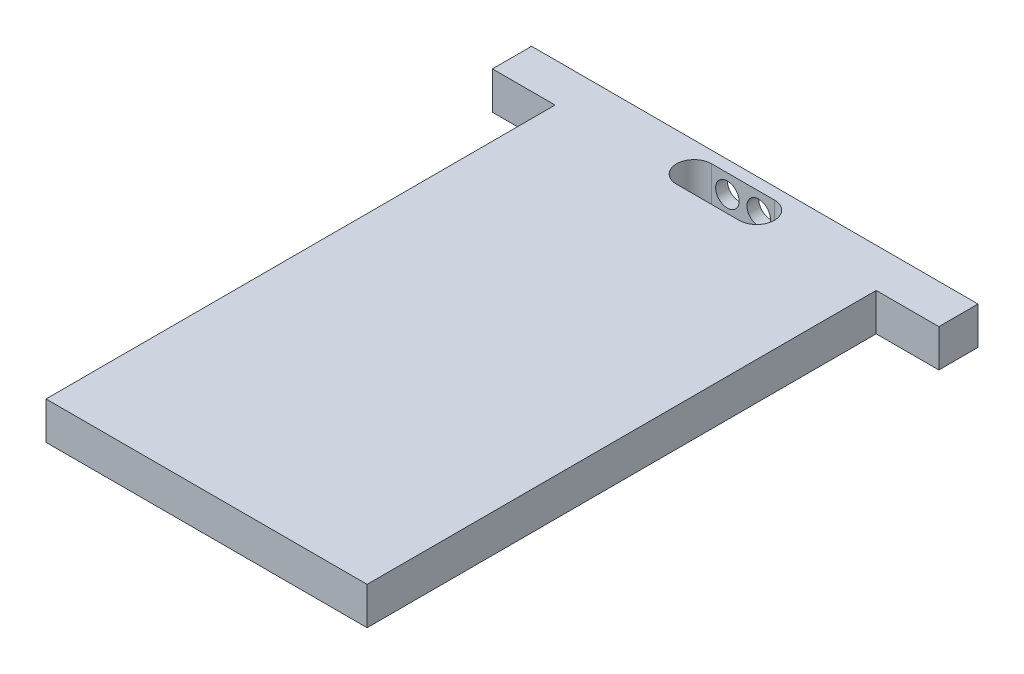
ISO-10303-21;
HEADER;
FILE_DESCRIPTION(('STEP AP214'),'2;1');
FILE_NAME('part.step','',(''),(''),'','','');
FILE_SCHEMA(('AUTOMOTIVE_DESIGN { 1 0 10303 214 1 1 1 1 }'));
ENDSEC;
DATA;
#1=APPLICATION_CONTEXT('core data for automotive mechanical design processes');
#2=APPLICATION_PROTOCOL_DEFINITION('international standard','automotive_design',2000,#1);
#3=PRODUCT_CONTEXT('',#1,'mechanical');
#4=PRODUCT('Part','Part','',(#3));
#5=PRODUCT_RELATED_PRODUCT_CATEGORY('part','',(#4));
#6=PRODUCT_DEFINITION_FORMATION('','',#4);
#7=PRODUCT_DEFINITION_CONTEXT('part definition',#1,'design');
#8=PRODUCT_DEFINITION('design','',#6,#7);
#9=PRODUCT_DEFINITION_SHAPE('','',#8);
#10=(LENGTH_UNIT() NAMED_UNIT(*) SI_UNIT(.MILLI.,.METRE.));
#11=(NAMED_UNIT(*) PLANE_ANGLE_UNIT() SI_UNIT($,.RADIAN.));
#12=(NAMED_UNIT(*) SI_UNIT($,.STERADIAN.) SOLID_ANGLE_UNIT());
#13=UNCERTAINTY_MEASURE_WITH_UNIT(LENGTH_MEASURE(1.E-05),#10,'distance_accuracy_value','');
#14=(GEOMETRIC_REPRESENTATION_CONTEXT(3) GLOBAL_UNCERTAINTY_ASSIGNED_CONTEXT((#13)) GLOBAL_UNIT_ASSIGNED_CONTEXT((#10,
#11,#12)) REPRESENTATION_CONTEXT('',''));
#15=CARTESIAN_POINT('',(0.,0.,0.));
#16=DIRECTION('',(0.,0.,1.));
#17=DIRECTION('',(1.,0.,0.));
#18=AXIS2_PLACEMENT_3D('',#15,#16,#17);
#19=CARTESIAN_POINT('',(20.5,-2.4,32.5));
#20=DIRECTION('',(-1.,0.,0.));
#21=DIRECTION('',(0.,0.,1.));
#22=AXIS2_PLACEMENT_3D('',#19,#20,#21);
#23=PLANE('',#22);
#24=DIRECTION('',(0.,1.,0.));
#25=VECTOR('',#24,1.);
#26=CARTESIAN_POINT('',(20.5,-2.4,-32.5));
#27=LINE('',#26,#25);
#28=CARTESIAN_POINT('',(20.5,-2.4,-32.5));
#29=VERTEX_POINT('',#28);
#30=CARTESIAN_POINT('',(20.5,2.4,-32.5));
#31=VERTEX_POINT('',#30);
#32=EDGE_CURVE('E189',#29,#31,#27,.T.);
#33=ORIENTED_EDGE('',*,*,#32,.T.);
#34=DIRECTION('',(0.,0.,-1.));
#35=VECTOR('',#34,1.);
#36=CARTESIAN_POINT('',(20.5,2.4,32.5));
#37=LINE('',#36,#35);
#38=CARTESIAN_POINT('',(20.5,2.4,32.5));
#39=VERTEX_POINT('',#38);
#40=EDGE_CURVE('E11',#39,#31,#37,.T.);
#41=ORIENTED_EDGE('',*,*,#40,.F.);
#42=DIRECTION('',(0.,1.,0.));
#43=VECTOR('',#42,1.);
#44=CARTESIAN_POINT('',(20.5,-2.4,32.5));
#45=LINE('',#44,#43);
#46=CARTESIAN_POINT('',(20.5,-2.4,32.5));
#47=VERTEX_POINT('',#46);
#48=EDGE_CURVE('E196',#47,#39,#45,.T.);
#49=ORIENTED_EDGE('',*,*,#48,.F.);
#50=DIRECTION('',(0.,0.,-1.));
#51=VECTOR('',#50,1.);
#52=CARTESIAN_POINT('',(20.5,-2.4,32.5));
#53=LINE('',#52,#51);
#54=EDGE_CURVE('E206',#47,#29,#53,.T.);
#55=ORIENTED_EDGE('',*,*,#54,.T.);
#56=EDGE_LOOP('',(#33,#41,#49,#55));
#57=FACE_BOUND('',#56,.T.);
#58=ADVANCED_FACE('F33',(#57),#23,.F.);
#59=CARTESIAN_POINT('',(-20.5,2.4,32.5));
#60=DIRECTION('',(0.,-1.,0.));
#61=DIRECTION('',(0.,0.,-1.));
#62=AXIS2_PLACEMENT_3D('',#59,#60,#61);
#63=PLANE('',#62);
#64=DIRECTION('',(1.,0.,0.));
#65=VECTOR('',#64,1.);
#66=CARTESIAN_POINT('',(-4.,2.4,-31.5));
#67=LINE('',#66,#65);
#68=CARTESIAN_POINT('',(-4.,2.4,-31.5));
#69=VERTEX_POINT('',#68);
#70=CARTESIAN_POINT('',(4.,2.4,-31.5));
#71=VERTEX_POINT('',#70);
#72=EDGE_CURVE('E151',#69,#71,#67,.T.);
#73=ORIENTED_EDGE('',*,*,#72,.F.);
#74=CARTESIAN_POINT('',(-4.,2.4,-33.75));
#75=DIRECTION('',(0.,1.,0.));
#76=DIRECTION('',(0.,0.,1.));
#77=AXIS2_PLACEMENT_3D('',#74,#75,#76);
#78=CIRCLE('',#77,2.25);
#79=CARTESIAN_POINT('',(-4.,2.4,-36.));
#80=VERTEX_POINT('',#79);
#81=EDGE_CURVE('E47',#80,#69,#78,.T.);
#82=ORIENTED_EDGE('',*,*,#81,.F.);
#83=DIRECTION('',(-1.,0.,0.));
#84=VECTOR('',#83,1.);
#85=CARTESIAN_POINT('',(-4.,2.4,-36.));
#86=LINE('',#85,#84);
#87=CARTESIAN_POINT('',(4.,2.4,-36.));
#88=VERTEX_POINT('',#87);
#89=EDGE_CURVE('E139',#88,#80,#86,.T.);
#90=ORIENTED_EDGE('',*,*,#89,.F.);
#91=CARTESIAN_POINT('',(4.,2.4,-33.75));
#92=DIRECTION('',(0.,1.,0.));
#93=DIRECTION('',(0.,0.,1.));
#94=AXIS2_PLACEMENT_3D('',#91,#92,#93);
#95=CIRCLE('',#94,2.25);
#96=EDGE_CURVE('E142',#71,#88,#95,.T.);
#97=ORIENTED_EDGE('',*,*,#96,.F.);
#98=EDGE_LOOP('',(#73,#82,#90,#97));
#99=FACE_BOUND('',#98,.T.);
#100=ORIENTED_EDGE('',*,*,#40,.T.);
#101=DIRECTION('',(-1.,0.,0.));
#102=VECTOR('',#101,1.);
#103=CARTESIAN_POINT('',(-28.5,2.4,-32.5));
#104=LINE('',#103,#102);
#105=CARTESIAN_POINT('',(28.5,2.4,-32.5));
#106=VERTEX_POINT('',#105);
#107=EDGE_CURVE('E179',#106,#31,#104,.T.);
#108=ORIENTED_EDGE('',*,*,#107,.F.);
#109=DIRECTION('',(0.,0.,1.));
#110=VECTOR('',#109,1.);
#111=CARTESIAN_POINT('',(28.5,2.4,-37.5));
#112=LINE('',#111,#110);
#113=CARTESIAN_POINT('',(28.5,2.4,-37.5));
#114=VERTEX_POINT('',#113);
#115=EDGE_CURVE('E175',#114,#106,#112,.T.);
#116=ORIENTED_EDGE('',*,*,#115,.F.);
#117=DIRECTION('',(-1.,0.,0.));
#118=VECTOR('',#117,1.);
#119=CARTESIAN_POINT('',(-28.5,2.4,-37.5));
#120=LINE('',#119,#118);
#121=CARTESIAN_POINT('',(-28.5,2.4,-37.5));
#122=VERTEX_POINT('',#121);
#123=EDGE_CURVE('E165',#114,#122,#120,.T.);
#124=ORIENTED_EDGE('',*,*,#123,.T.);
#125=DIRECTION('',(0.,0.,1.));
#126=VECTOR('',#125,1.);
#127=CARTESIAN_POINT('',(-28.5,2.4,-37.5));
#128=LINE('',#127,#126);
#129=CARTESIAN_POINT('',(-28.5,2.4,-32.5));
#130=VERTEX_POINT('',#129);
#131=EDGE_CURVE('E192',#122,#130,#128,.T.);
#132=ORIENTED_EDGE('',*,*,#131,.T.);
#133=CARTESIAN_POINT('',(-20.5,2.4,-32.5));
#134=VERTEX_POINT('',#133);
#135=EDGE_CURVE('E178',#134,#130,#104,.T.);
#136=ORIENTED_EDGE('',*,*,#135,.F.);
#137=DIRECTION('',(0.,0.,-1.));
#138=VECTOR('',#137,1.);
#139=CARTESIAN_POINT('',(-20.5,2.4,32.5));
#140=LINE('',#139,#138);
#141=CARTESIAN_POINT('',(-20.5,2.4,32.5));
#142=VERTEX_POINT('',#141);
#143=EDGE_CURVE('E40',#142,#134,#140,.T.);
#144=ORIENTED_EDGE('',*,*,#143,.F.);
#145=DIRECTION('',(-1.,0.,0.));
#146=VECTOR('',#145,1.);
#147=CARTESIAN_POINT('',(-20.5,2.4,32.5));
#148=LINE('',#147,#146);
#149=EDGE_CURVE('E199',#39,#142,#148,.T.);
#150=ORIENTED_EDGE('',*,*,#149,.F.);
#151=EDGE_LOOP('',(#100,#108,#116,#124,#132,#136,#144,#150));
#152=FACE_BOUND('',#151,.T.);
#153=ADVANCED_FACE('F223',(#99,#152),#63,.F.);
#154=CARTESIAN_POINT('',(-20.5,-2.4,32.5));
#155=DIRECTION('',(1.,0.,0.));
#156=DIRECTION('',(0.,0.,-1.));
#157=AXIS2_PLACEMENT_3D('',#154,#155,#156);
#158=PLANE('',#157);
#159=DIRECTION('',(0.,-1.,0.));
#160=VECTOR('',#159,1.);
#161=CARTESIAN_POINT('',(-20.5,-2.4,-32.5));
#162=LINE('',#161,#160);
#163=CARTESIAN_POINT('',(-20.5,-2.4,-32.5));
#164=VERTEX_POINT('',#163);
#165=EDGE_CURVE('E200',#134,#164,#162,.T.);
#166=ORIENTED_EDGE('',*,*,#165,.T.);
#167=DIRECTION('',(0.,0.,-1.));
#168=VECTOR('',#167,1.);
#169=CARTESIAN_POINT('',(-20.5,-2.4,32.5));
#170=LINE('',#169,#168);
#171=CARTESIAN_POINT('',(-20.5,-2.4,32.5));
#172=VERTEX_POINT('',#171);
#173=EDGE_CURVE('E213',#172,#164,#170,.T.);
#174=ORIENTED_EDGE('',*,*,#173,.F.);
#175=DIRECTION('',(0.,-1.,0.));
#176=VECTOR('',#175,1.);
#177=CARTESIAN_POINT('',(-20.5,-2.4,32.5));
#178=LINE('',#177,#176);
#179=EDGE_CURVE('E202',#142,#172,#178,.T.);
#180=ORIENTED_EDGE('',*,*,#179,.F.);
#181=ORIENTED_EDGE('',*,*,#143,.T.);
#182=EDGE_LOOP('',(#166,#174,#180,#181));
#183=FACE_BOUND('',#182,.T.);
#184=ADVANCED_FACE('F219',(#183),#158,.F.);
#185=CARTESIAN_POINT('',(-20.5,-2.4,32.5));
#186=DIRECTION('',(0.,1.,0.));
#187=DIRECTION('',(0.,0.,1.));
#188=AXIS2_PLACEMENT_3D('',#185,#186,#187);
#189=PLANE('',#188);
#190=DIRECTION('',(-1.,0.,0.));
#191=VECTOR('',#190,1.);
#192=CARTESIAN_POINT('',(-4.,-2.4,-36.));
#193=LINE('',#192,#191);
#194=CARTESIAN_POINT('',(4.,-2.4,-36.));
#195=VERTEX_POINT('',#194);
#196=CARTESIAN_POINT('',(-4.,-2.4,-36.));
#197=VERTEX_POINT('',#196);
#198=EDGE_CURVE('E129',#195,#197,#193,.T.);
#199=ORIENTED_EDGE('',*,*,#198,.T.);
#200=CARTESIAN_POINT('',(-4.,-2.4,-33.75));
#201=DIRECTION('',(0.,1.,0.));
#202=DIRECTION('',(0.,0.,1.));
#203=AXIS2_PLACEMENT_3D('',#200,#201,#202);
#204=CIRCLE('',#203,2.25);
#205=CARTESIAN_POINT('',(-4.,-2.4,-31.5));
#206=VERTEX_POINT('',#205);
#207=EDGE_CURVE('E123',#197,#206,#204,.T.);
#208=ORIENTED_EDGE('',*,*,#207,.T.);
#209=DIRECTION('',(1.,0.,0.));
#210=VECTOR('',#209,1.);
#211=CARTESIAN_POINT('',(-4.,-2.4,-31.5));
#212=LINE('',#211,#210);
#213=CARTESIAN_POINT('',(4.,-2.4,-31.5));
#214=VERTEX_POINT('',#213);
#215=EDGE_CURVE('E132',#206,#214,#212,.T.);
#216=ORIENTED_EDGE('',*,*,#215,.T.);
#217=CARTESIAN_POINT('',(4.,-2.4,-33.75));
#218=DIRECTION('',(0.,1.,0.));
#219=DIRECTION('',(0.,0.,1.));
#220=AXIS2_PLACEMENT_3D('',#217,#218,#219);
#221=CIRCLE('',#220,2.25);
#222=EDGE_CURVE('E55',#214,#195,#221,.T.);
#223=ORIENTED_EDGE('',*,*,#222,.T.);
#224=EDGE_LOOP('',(#199,#208,#216,#223));
#225=FACE_BOUND('',#224,.T.);
#226=ORIENTED_EDGE('',*,*,#173,.T.);
#227=DIRECTION('',(1.,0.,0.));
#228=VECTOR('',#227,1.);
#229=CARTESIAN_POINT('',(-28.5,-2.4,-32.5));
#230=LINE('',#229,#228);
#231=CARTESIAN_POINT('',(-28.5,-2.4,-32.5));
#232=VERTEX_POINT('',#231);
#233=EDGE_CURVE('E166',#232,#164,#230,.T.);
#234=ORIENTED_EDGE('',*,*,#233,.F.);
#235=DIRECTION('',(0.,0.,1.));
#236=VECTOR('',#235,1.);
#237=CARTESIAN_POINT('',(-28.5,-2.4,-37.5));
#238=LINE('',#237,#236);
#239=CARTESIAN_POINT('',(-28.5,-2.4,-37.5));
#240=VERTEX_POINT('',#239);
#241=EDGE_CURVE('E190',#240,#232,#238,.T.);
#242=ORIENTED_EDGE('',*,*,#241,.F.);
#243=DIRECTION('',(1.,0.,0.));
#244=VECTOR('',#243,1.);
#245=CARTESIAN_POINT('',(-28.5,-2.4,-37.5));
#246=LINE('',#245,#244);
#247=CARTESIAN_POINT('',(28.5,-2.4,-37.5));
#248=VERTEX_POINT('',#247);
#249=EDGE_CURVE('E172',#240,#248,#246,.T.);
#250=ORIENTED_EDGE('',*,*,#249,.T.);
#251=DIRECTION('',(0.,0.,1.));
#252=VECTOR('',#251,1.);
#253=CARTESIAN_POINT('',(28.5,-2.4,-37.5));
#254=LINE('',#253,#252);
#255=CARTESIAN_POINT('',(28.5,-2.4,-32.5));
#256=VERTEX_POINT('',#255);
#257=EDGE_CURVE('E186',#248,#256,#254,.T.);
#258=ORIENTED_EDGE('',*,*,#257,.T.);
#259=EDGE_CURVE('E184',#29,#256,#230,.T.);
#260=ORIENTED_EDGE('',*,*,#259,.F.);
#261=ORIENTED_EDGE('',*,*,#54,.F.);
#262=DIRECTION('',(1.,0.,0.));
#263=VECTOR('',#262,1.);
#264=CARTESIAN_POINT('',(-20.5,-2.4,32.5));
#265=LINE('',#264,#263);
#266=EDGE_CURVE('E204',#172,#47,#265,.T.);
#267=ORIENTED_EDGE('',*,*,#266,.F.);
#268=EDGE_LOOP('',(#226,#234,#242,#250,#258,#260,#261,#267));
#269=FACE_BOUND('',#268,.T.);
#270=ADVANCED_FACE('F136',(#225,#269),#189,.F.);
#271=CARTESIAN_POINT('',(0.,0.,32.5));
#272=DIRECTION('',(0.,0.,-1.));
#273=DIRECTION('',(-1.,0.,0.));
#274=AXIS2_PLACEMENT_3D('',#271,#272,#273);
#275=PLANE('',#274);
#276=ORIENTED_EDGE('',*,*,#48,.T.);
#277=ORIENTED_EDGE('',*,*,#149,.T.);
#278=ORIENTED_EDGE('',*,*,#179,.T.);
#279=ORIENTED_EDGE('',*,*,#266,.T.);
#280=EDGE_LOOP('',(#276,#277,#278,#279));
#281=FACE_BOUND('',#280,.T.);
#282=ADVANCED_FACE('F233',(#281),#275,.F.);
#283=CARTESIAN_POINT('',(0.,0.,-32.5));
#284=DIRECTION('',(0.,0.,-1.));
#285=DIRECTION('',(-1.,0.,0.));
#286=AXIS2_PLACEMENT_3D('',#283,#284,#285);
#287=PLANE('',#286);
#288=ORIENTED_EDGE('',*,*,#32,.F.);
#289=ORIENTED_EDGE('',*,*,#259,.T.);
#290=DIRECTION('',(0.,1.,0.));
#291=VECTOR('',#290,1.);
#292=CARTESIAN_POINT('',(28.5,-2.4,-32.5));
#293=LINE('',#292,#291);
#294=EDGE_CURVE('E158',#256,#106,#293,.T.);
#295=ORIENTED_EDGE('',*,*,#294,.T.);
#296=ORIENTED_EDGE('',*,*,#107,.T.);
#297=EDGE_LOOP('',(#288,#289,#295,#296));
#298=FACE_BOUND('',#297,.T.);
#299=ADVANCED_FACE('F240',(#298),#287,.F.);
#300=CARTESIAN_POINT('',(28.5,-2.4,-37.5));
#301=DIRECTION('',(1.,0.,0.));
#302=DIRECTION('',(0.,0.,-1.));
#303=AXIS2_PLACEMENT_3D('',#300,#301,#302);
#304=PLANE('',#303);
#305=ORIENTED_EDGE('',*,*,#294,.F.);
#306=ORIENTED_EDGE('',*,*,#257,.F.);
#307=DIRECTION('',(0.,1.,0.));
#308=VECTOR('',#307,1.);
#309=CARTESIAN_POINT('',(28.5,-2.4,-37.5));
#310=LINE('',#309,#308);
#311=EDGE_CURVE('E162',#248,#114,#310,.T.);
#312=ORIENTED_EDGE('',*,*,#311,.T.);
#313=ORIENTED_EDGE('',*,*,#115,.T.);
#314=EDGE_LOOP('',(#305,#306,#312,#313));
#315=FACE_BOUND('',#314,.T.);
#316=ADVANCED_FACE('F242',(#315),#304,.T.);
#317=CARTESIAN_POINT('',(-28.5,-2.4,-37.5));
#318=DIRECTION('',(-1.,0.,0.));
#319=DIRECTION('',(0.,0.,1.));
#320=AXIS2_PLACEMENT_3D('',#317,#318,#319);
#321=PLANE('',#320);
#322=DIRECTION('',(0.,-1.,0.));
#323=VECTOR('',#322,1.);
#324=CARTESIAN_POINT('',(-28.5,-2.4,-32.5));
#325=LINE('',#324,#323);
#326=EDGE_CURVE('E181',#130,#232,#325,.T.);
#327=ORIENTED_EDGE('',*,*,#326,.F.);
#328=ORIENTED_EDGE('',*,*,#131,.F.);
#329=DIRECTION('',(0.,-1.,0.));
#330=VECTOR('',#329,1.);
#331=CARTESIAN_POINT('',(-28.5,-2.4,-37.5));
#332=LINE('',#331,#330);
#333=EDGE_CURVE('E169',#122,#240,#332,.T.);
#334=ORIENTED_EDGE('',*,*,#333,.T.);
#335=ORIENTED_EDGE('',*,*,#241,.T.);
#336=EDGE_LOOP('',(#327,#328,#334,#335));
#337=FACE_BOUND('',#336,.T.);
#338=ADVANCED_FACE('F249',(#337),#321,.T.);
#339=CARTESIAN_POINT('',(0.,0.,-37.5));
#340=DIRECTION('',(0.,0.,-1.));
#341=DIRECTION('',(-1.,0.,0.));
#342=AXIS2_PLACEMENT_3D('',#339,#340,#341);
#343=PLANE('',#342);
#344=CARTESIAN_POINT('',(-2.,0.,-37.5));
#345=DIRECTION('',(0.,0.,-1.));
#346=DIRECTION('',(-1.,0.,0.));
#347=AXIS2_PLACEMENT_3D('',#344,#345,#346);
#348=CIRCLE('',#347,1.5);
#349=CARTESIAN_POINT('',(-3.5,0.,-37.5));
#350=VERTEX_POINT('',#349);
#351=EDGE_CURVE('E307',#350,#350,#348,.T.);
#352=ORIENTED_EDGE('',*,*,#351,.F.);
#353=EDGE_LOOP('',(#352));
#354=FACE_BOUND('',#353,.T.);
#355=CARTESIAN_POINT('',(2.,0.,-37.5));
#356=DIRECTION('',(0.,0.,-1.));
#357=DIRECTION('',(1.,0.,0.));
#358=AXIS2_PLACEMENT_3D('',#355,#356,#357);
#359=CIRCLE('',#358,1.5);
#360=CARTESIAN_POINT('',(3.5,0.,-37.5));
#361=VERTEX_POINT('',#360);
#362=EDGE_CURVE('E312',#361,#361,#359,.T.);
#363=ORIENTED_EDGE('',*,*,#362,.F.);
#364=EDGE_LOOP('',(#363));
#365=FACE_BOUND('',#364,.T.);
#366=ORIENTED_EDGE('',*,*,#311,.F.);
#367=ORIENTED_EDGE('',*,*,#249,.F.);
#368=ORIENTED_EDGE('',*,*,#333,.F.);
#369=ORIENTED_EDGE('',*,*,#123,.F.);
#370=EDGE_LOOP('',(#366,#367,#368,#369));
#371=FACE_BOUND('',#370,.T.);
#372=ADVANCED_FACE('F246',(#354,#365,#371),#343,.T.);
#373=ORIENTED_EDGE('',*,*,#165,.F.);
#374=ORIENTED_EDGE('',*,*,#135,.T.);
#375=ORIENTED_EDGE('',*,*,#326,.T.);
#376=ORIENTED_EDGE('',*,*,#233,.T.);
#377=EDGE_LOOP('',(#373,#374,#375,#376));
#378=FACE_BOUND('',#377,.T.);
#379=ADVANCED_FACE('F226',(#378),#287,.F.);
#380=CARTESIAN_POINT('',(-4.,-2.4,-33.75));
#381=DIRECTION('',(0.,1.,0.));
#382=DIRECTION('',(0.,0.,1.));
#383=AXIS2_PLACEMENT_3D('',#380,#381,#382);
#384=CYLINDRICAL_SURFACE('',#383,2.25);
#385=ORIENTED_EDGE('',*,*,#81,.T.);
#386=DIRECTION('',(0.,1.,0.));
#387=VECTOR('',#386,1.);
#388=CARTESIAN_POINT('',(-4.,-2.4,-31.5));
#389=LINE('',#388,#387);
#390=EDGE_CURVE('E119',#206,#69,#389,.T.);
#391=ORIENTED_EDGE('',*,*,#390,.F.);
#392=ORIENTED_EDGE('',*,*,#207,.F.);
#393=DIRECTION('',(0.,1.,0.));
#394=VECTOR('',#393,1.);
#395=CARTESIAN_POINT('',(-4.,-2.4,-36.));
#396=LINE('',#395,#394);
#397=EDGE_CURVE('E156',#197,#80,#396,.T.);
#398=ORIENTED_EDGE('',*,*,#397,.T.);
#399=EDGE_LOOP('',(#385,#391,#392,#398));
#400=FACE_BOUND('',#399,.T.);
#401=ADVANCED_FACE('F121',(#400),#384,.F.);
#402=CARTESIAN_POINT('',(-4.,-2.4,-36.));
#403=DIRECTION('',(0.,0.,-1.));
#404=DIRECTION('',(-1.,0.,0.));
#405=AXIS2_PLACEMENT_3D('',#402,#403,#404);
#406=PLANE('',#405);
#407=CARTESIAN_POINT('',(-2.,0.,-36.));
#408=DIRECTION('',(0.,0.,-1.));
#409=DIRECTION('',(-1.,0.,0.));
#410=AXIS2_PLACEMENT_3D('',#407,#408,#409);
#411=CIRCLE('',#410,1.5);
#412=CARTESIAN_POINT('',(-3.5,0.,-36.));
#413=VERTEX_POINT('',#412);
#414=EDGE_CURVE('E152',#413,#413,#411,.F.);
#415=ORIENTED_EDGE('',*,*,#414,.F.);
#416=EDGE_LOOP('',(#415));
#417=FACE_BOUND('',#416,.T.);
#418=CARTESIAN_POINT('',(2.,0.,-36.));
#419=DIRECTION('',(0.,0.,-1.));
#420=DIRECTION('',(-1.,0.,0.));
#421=AXIS2_PLACEMENT_3D('',#418,#419,#420);
#422=CIRCLE('',#421,1.5);
#423=CARTESIAN_POINT('',(0.5,0.,-36.));
#424=VERTEX_POINT('',#423);
#425=EDGE_CURVE('E145',#424,#424,#422,.F.);
#426=ORIENTED_EDGE('',*,*,#425,.F.);
#427=EDGE_LOOP('',(#426));
#428=FACE_BOUND('',#427,.T.);
#429=ORIENTED_EDGE('',*,*,#89,.T.);
#430=ORIENTED_EDGE('',*,*,#397,.F.);
#431=ORIENTED_EDGE('',*,*,#198,.F.);
#432=DIRECTION('',(0.,1.,0.));
#433=VECTOR('',#432,1.);
#434=CARTESIAN_POINT('',(4.,-2.4,-36.));
#435=LINE('',#434,#433);
#436=EDGE_CURVE('E159',#195,#88,#435,.T.);
#437=ORIENTED_EDGE('',*,*,#436,.T.);
#438=EDGE_LOOP('',(#429,#430,#431,#437));
#439=FACE_BOUND('',#438,.T.);
#440=ADVANCED_FACE('F282',(#417,#428,#439),#406,.F.);
#441=CARTESIAN_POINT('',(4.,-2.4,-33.75));
#442=DIRECTION('',(0.,1.,0.));
#443=DIRECTION('',(0.,0.,1.));
#444=AXIS2_PLACEMENT_3D('',#441,#442,#443);
#445=CYLINDRICAL_SURFACE('',#444,2.25);
#446=ORIENTED_EDGE('',*,*,#96,.T.);
#447=ORIENTED_EDGE('',*,*,#436,.F.);
#448=ORIENTED_EDGE('',*,*,#222,.F.);
#449=DIRECTION('',(0.,1.,0.));
#450=VECTOR('',#449,1.);
#451=CARTESIAN_POINT('',(4.,-2.4,-31.5));
#452=LINE('',#451,#450);
#453=EDGE_CURVE('E128',#214,#71,#452,.T.);
#454=ORIENTED_EDGE('',*,*,#453,.T.);
#455=EDGE_LOOP('',(#446,#447,#448,#454));
#456=FACE_BOUND('',#455,.T.);
#457=ADVANCED_FACE('F287',(#456),#445,.F.);
#458=CARTESIAN_POINT('',(-4.,-2.4,-31.5));
#459=DIRECTION('',(0.,0.,1.));
#460=DIRECTION('',(1.,0.,0.));
#461=AXIS2_PLACEMENT_3D('',#458,#459,#460);
#462=PLANE('',#461);
#463=ORIENTED_EDGE('',*,*,#72,.T.);
#464=ORIENTED_EDGE('',*,*,#453,.F.);
#465=ORIENTED_EDGE('',*,*,#215,.F.);
#466=ORIENTED_EDGE('',*,*,#390,.T.);
#467=EDGE_LOOP('',(#463,#464,#465,#466));
#468=FACE_BOUND('',#467,.T.);
#469=ADVANCED_FACE('F133',(#468),#462,.F.);
#470=CARTESIAN_POINT('',(2.,0.,32.501));
#471=DIRECTION('',(0.,0.,-1.));
#472=DIRECTION('',(-1.,0.,0.));
#473=AXIS2_PLACEMENT_3D('',#470,#471,#472);
#474=CYLINDRICAL_SURFACE('',#473,1.5);
#475=ORIENTED_EDGE('',*,*,#362,.T.);
#476=EDGE_LOOP('',(#475));
#477=FACE_BOUND('',#476,.T.);
#478=ORIENTED_EDGE('',*,*,#425,.T.);
#479=EDGE_LOOP('',(#478));
#480=FACE_BOUND('',#479,.T.);
#481=ADVANCED_FACE('F293',(#477,#480),#474,.F.);
#482=CARTESIAN_POINT('',(-2.,0.,32.501));
#483=DIRECTION('',(0.,0.,-1.));
#484=DIRECTION('',(-1.,0.,0.));
#485=AXIS2_PLACEMENT_3D('',#482,#483,#484);
#486=CYLINDRICAL_SURFACE('',#485,1.5);
#487=ORIENTED_EDGE('',*,*,#351,.T.);
#488=EDGE_LOOP('',(#487));
#489=FACE_BOUND('',#488,.T.);
#490=ORIENTED_EDGE('',*,*,#414,.T.);
#491=EDGE_LOOP('',(#490));
#492=FACE_BOUND('',#491,.T.);
#493=ADVANCED_FACE('F298',(#489,#492),#486,.F.);
#494=CLOSED_SHELL('',(#58,#153,#184,#270,#282,#299,#316,#338,#372,#379,#401,#440,#457,#469,#481,#493));
#495=MANIFOLD_SOLID_BREP('B2',#494);
#496=ADVANCED_BREP_SHAPE_REPRESENTATION('',(#18,#495),#14);
#497=SHAPE_DEFINITION_REPRESENTATION(#9,#496);
ENDSEC;
END-ISO-10303-21;
